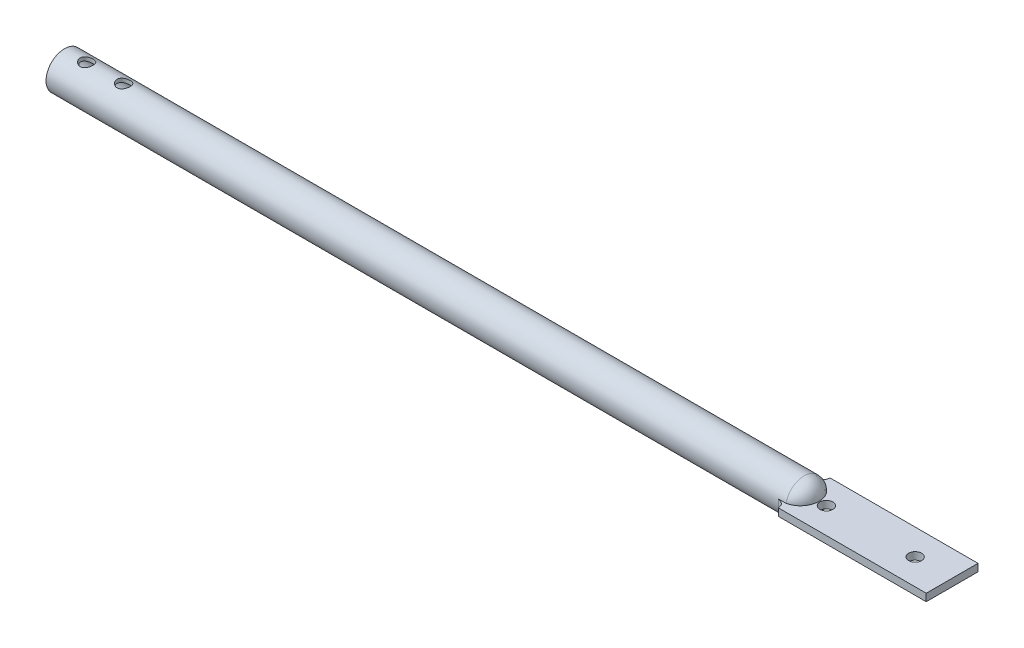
from build123d import *

# Parameters (mm, degrees)
SKETCH1_W           = 200
SKETCH1_H           = 1
SKETCH2_W           = 40
SKETCH2_H           = 2
BOSS_EXTRUDE1_DEPTH = 7
SKETCH2_2_W         = 40
SKETCH2_2_H         = 2
BOSS_EXTRUDE2_DEPTH = 7
SKETCH3_R           = 1.75
CUT_EXTRUDE1_DEPTH  = 14
SKETCH5_R           = 1.75
CUT_EXTRUDE2_DEPTH  = 7
SKETCH6_R           = 2.75
CUT_EXTRUDE3_DEPTH  = 14
BOSS_EXTRUDE4_DEPTH = 1
REVOLVE6_ANGLE      = 90
REVOLVE7_ANGLE      = 90


with BuildPart() as part:
    # Sketch1 → Revolve1 (revolve)
    with BuildSketch(Plane.XY, mode=Mode.PRIVATE) as revolve1_sk:
        with Locations((100, 4.5)):
            Rectangle(SKETCH1_W, SKETCH1_H)
    revolve(revolve1_sk.sketch.rotate(Axis((0, 0, 0), (1, 0, 0)), 90), axis=Axis((0, 0, 0), (1, 0, 0)))

    # Sketch2 → Boss-Extrude1 (add, symmetric)
    with BuildSketch(Plane.XY):
        with Locations((220, 0)):
            Rectangle(SKETCH2_W, SKETCH2_H)
    extrude(amount=BOSS_EXTRUDE1_DEPTH, both=True)

    # Sketch2_2 → Boss-Extrude2 (add, symmetric)
    with BuildSketch(Plane.XY):
        with Locations((220, 0)):
            Rectangle(SKETCH2_2_W, SKETCH2_2_H)
    extrude(amount=BOSS_EXTRUDE2_DEPTH, both=True)

    # Sketch3 → Cut-Extrude1 (cut)
    with BuildSketch(Plane.XZ.offset(1)):
        with Locations(Location((230, 0, 0), (0, 0, 270))):
            Circle(SKETCH3_R)
        with Locations(Location((206, 0, 0), (0, 0, 270))):
            Circle(SKETCH3_R)
    extrude(amount=-CUT_EXTRUDE1_DEPTH, mode=Mode.SUBTRACT)

    # Sketch5 → Cut-Extrude2 (cut, symmetric)
    with BuildSketch(Plane(origin=(0, 0, 0), x_dir=(1, 0, 0), z_dir=(0, 1, 0))):
        with Locations(Location((6, 0, 0), (0, 0, 270))):
            Circle(SKETCH5_R)
        with Locations(Location((16, 0, 0), (0, 0, 270))):
            Circle(SKETCH5_R)
    extrude(amount=CUT_EXTRUDE2_DEPTH, both=True, mode=Mode.SUBTRACT)

    # Sketch6 → Cut-Extrude3 (cut)
    with BuildSketch(Plane(origin=(0, 0, 0), x_dir=(1, 0, 0), z_dir=(0, 1, 0))):
        with Locations(Location((194, 0, 0), (0, 0, 270))):
            Circle(SKETCH6_R)
    extrude(amount=-CUT_EXTRUDE3_DEPTH, mode=Mode.SUBTRACT)

    # Sketch7 → Boss-Extrude4 (add, symmetric)
    with BuildSketch(Plane(origin=(0, 0, 0), x_dir=(1, 0, 0), z_dir=(0, 1, 0))):
        with BuildLine():
            Line((198, -5), (198, -4.5))
            Line((198, -4.5), (200.5, -4.5))
            Line((200.5, -4.5), (200.5, -7))
            Line((200.5, -7), (200, -7))
            ThreePointArc((200, -7), (199.414213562, -5.585786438), (198, -5))
        make_face()
    boss_extrude4 = extrude(amount=BOSS_EXTRUDE4_DEPTH, both=True)

    # Mirror1: Boss-Extrude4 across plane
    add(boss_extrude4.mirror(Plane.XY))

    # Sketch9 → Revolve6 (revolve)
    with BuildSketch(Plane(origin=(200, 0, 0), x_dir=(0, 0, -1), z_dir=(1, 0, 0))):
        with BuildLine():
            Line((-4.898979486, 1), (-3.872983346, 1))
            ThreePointArc((-3.872983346, 1), (0, 4), (3.872983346, 1))
            Line((3.872983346, 1), (4.898979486, 1))
            ThreePointArc((4.898979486, 1), (0, 5), (-4.898979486, 1))
        make_face()
    revolve(axis=Axis((200, 1, 4.898979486), (0, 0, -1)), revolution_arc=REVOLVE6_ANGLE)

    # Sketch10 → Revolve7 (revolve)
    with BuildSketch(Plane(origin=(200, 0, 0), x_dir=(0, 0, -1), z_dir=(1, 0, 0))):
        with BuildLine():
            Line((-3.872983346, -1), (-4.898979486, -1))
            ThreePointArc((-4.898979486, -1), (0, -5), (4.898979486, -1))
            Line((4.898979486, -1), (3.872983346, -1))
            ThreePointArc((3.872983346, -1), (0, -4), (-3.872983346, -1))
        make_face()
    revolve(axis=Axis((200, -1, 3.872983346), (0, 0, 1)), revolution_arc=REVOLVE7_ANGLE)


solid = part.part
